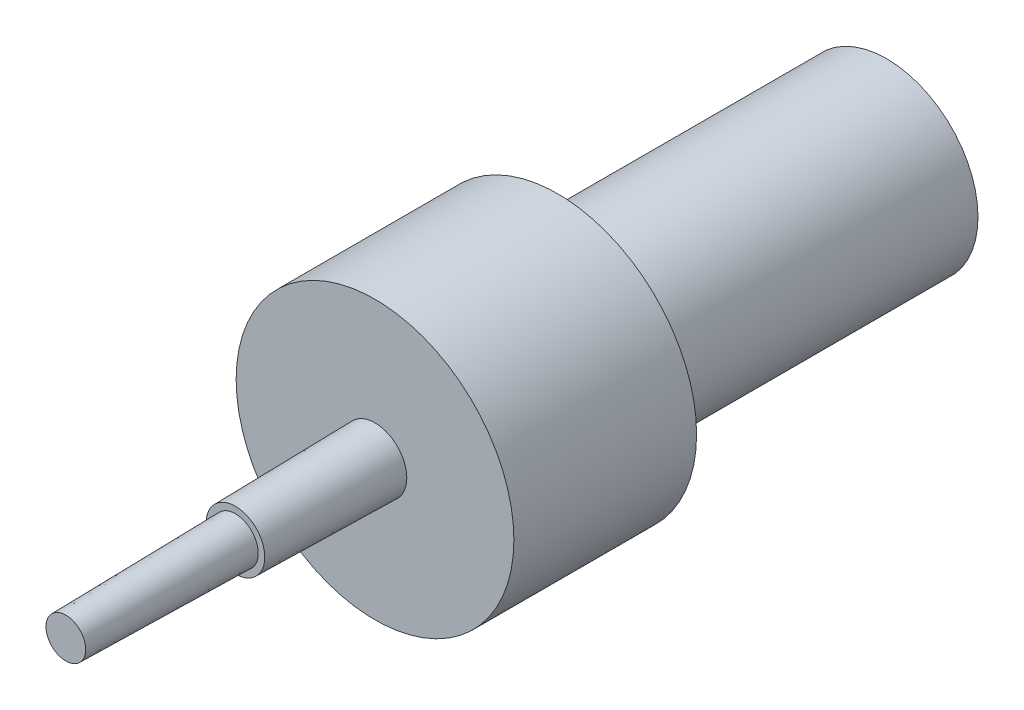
ISO-10303-21;
HEADER;
FILE_DESCRIPTION(('STEP AP214'),'2;1');
FILE_NAME('part.step','',(''),(''),'','','');
FILE_SCHEMA(('AUTOMOTIVE_DESIGN { 1 0 10303 214 1 1 1 1 }'));
ENDSEC;
DATA;
#1=APPLICATION_CONTEXT('core data for automotive mechanical design processes');
#2=APPLICATION_PROTOCOL_DEFINITION('international standard','automotive_design',2000,#1);
#3=PRODUCT_CONTEXT('',#1,'mechanical');
#4=PRODUCT('Part','Part','',(#3));
#5=PRODUCT_RELATED_PRODUCT_CATEGORY('part','',(#4));
#6=PRODUCT_DEFINITION_FORMATION('','',#4);
#7=PRODUCT_DEFINITION_CONTEXT('part definition',#1,'design');
#8=PRODUCT_DEFINITION('design','',#6,#7);
#9=PRODUCT_DEFINITION_SHAPE('','',#8);
#10=(LENGTH_UNIT() NAMED_UNIT(*) SI_UNIT(.MILLI.,.METRE.));
#11=(NAMED_UNIT(*) PLANE_ANGLE_UNIT() SI_UNIT($,.RADIAN.));
#12=(NAMED_UNIT(*) SI_UNIT($,.STERADIAN.) SOLID_ANGLE_UNIT());
#13=UNCERTAINTY_MEASURE_WITH_UNIT(LENGTH_MEASURE(1.E-05),#10,'distance_accuracy_value','');
#14=(GEOMETRIC_REPRESENTATION_CONTEXT(3) GLOBAL_UNCERTAINTY_ASSIGNED_CONTEXT((#13)) GLOBAL_UNIT_ASSIGNED_CONTEXT((#10,
#11,#12)) REPRESENTATION_CONTEXT('',''));
#15=CARTESIAN_POINT('',(0.,0.,0.));
#16=DIRECTION('',(0.,0.,1.));
#17=DIRECTION('',(1.,0.,0.));
#18=AXIS2_PLACEMENT_3D('',#15,#16,#17);
#19=CARTESIAN_POINT('',(0.,0.,0.));
#20=DIRECTION('',(0.,0.,1.));
#21=DIRECTION('',(1.,0.,0.));
#22=AXIS2_PLACEMENT_3D('',#19,#20,#21);
#23=PLANE('',#22);
#24=CARTESIAN_POINT('',(0.,0.,0.));
#25=DIRECTION('',(0.,0.,1.));
#26=DIRECTION('',(1.,0.,0.));
#27=AXIS2_PLACEMENT_3D('',#24,#25,#26);
#28=CIRCLE('',#27,3.8);
#29=CARTESIAN_POINT('',(3.8,0.,0.));
#30=VERTEX_POINT('',#29);
#31=EDGE_CURVE('E42',#30,#30,#28,.T.);
#32=ORIENTED_EDGE('',*,*,#31,.F.);
#33=EDGE_LOOP('',(#32));
#34=FACE_BOUND('',#33,.T.);
#35=CARTESIAN_POINT('',(0.,0.,0.));
#36=DIRECTION('',(0.,0.,1.));
#37=DIRECTION('',(1.,0.,0.));
#38=AXIS2_PLACEMENT_3D('',#35,#36,#37);
#39=CIRCLE('',#38,2.5);
#40=CARTESIAN_POINT('',(2.5,0.,0.));
#41=VERTEX_POINT('',#40);
#42=EDGE_CURVE('E10',#41,#41,#39,.F.);
#43=ORIENTED_EDGE('',*,*,#42,.F.);
#44=EDGE_LOOP('',(#43));
#45=FACE_BOUND('',#44,.T.);
#46=ADVANCED_FACE('F31',(#34,#45),#23,.F.);
#47=CARTESIAN_POINT('',(0.,0.,8.82));
#48=DIRECTION('',(0.,0.,1.));
#49=DIRECTION('',(1.,0.,0.));
#50=AXIS2_PLACEMENT_3D('',#47,#48,#49);
#51=PLANE('',#50);
#52=CARTESIAN_POINT('',(0.,0.,8.82));
#53=DIRECTION('',(0.,0.,1.));
#54=DIRECTION('',(1.,0.,0.));
#55=AXIS2_PLACEMENT_3D('',#52,#53,#54);
#56=CIRCLE('',#55,0.803321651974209);
#57=CARTESIAN_POINT('',(0.803321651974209,0.,8.82));
#58=VERTEX_POINT('',#57);
#59=EDGE_CURVE('E46',#58,#58,#56,.T.);
#60=ORIENTED_EDGE('',*,*,#59,.T.);
#61=EDGE_LOOP('',(#60));
#62=FACE_BOUND('',#61,.T.);
#63=CARTESIAN_POINT('',(0.,0.,8.82));
#64=DIRECTION('',(0.,0.,1.));
#65=DIRECTION('',(1.,0.,0.));
#66=AXIS2_PLACEMENT_3D('',#63,#64,#65);
#67=CIRCLE('',#66,0.625);
#68=CARTESIAN_POINT('',(0.625,0.,8.82));
#69=VERTEX_POINT('',#68);
#70=EDGE_CURVE('E57',#69,#69,#67,.T.);
#71=ORIENTED_EDGE('',*,*,#70,.F.);
#72=EDGE_LOOP('',(#71));
#73=FACE_BOUND('',#72,.T.);
#74=ADVANCED_FACE('F79',(#62,#73),#51,.T.);
#75=CARTESIAN_POINT('',(0.,0.,5.));
#76=DIRECTION('',(0.,0.,1.));
#77=DIRECTION('',(1.,0.,0.));
#78=AXIS2_PLACEMENT_3D('',#75,#76,#77);
#79=PLANE('',#78);
#80=CARTESIAN_POINT('',(0.,0.,5.));
#81=DIRECTION('',(0.,0.,1.));
#82=DIRECTION('',(1.,0.,0.));
#83=AXIS2_PLACEMENT_3D('',#80,#81,#82);
#84=CIRCLE('',#83,3.8);
#85=CARTESIAN_POINT('',(3.8,0.,5.));
#86=VERTEX_POINT('',#85);
#87=EDGE_CURVE('E38',#86,#86,#84,.T.);
#88=ORIENTED_EDGE('',*,*,#87,.T.);
#89=EDGE_LOOP('',(#88));
#90=FACE_BOUND('',#89,.T.);
#91=CARTESIAN_POINT('',(0.,0.,5.));
#92=DIRECTION('',(0.,0.,1.));
#93=DIRECTION('',(1.,0.,0.));
#94=AXIS2_PLACEMENT_3D('',#91,#92,#93);
#95=CIRCLE('',#94,0.87);
#96=CARTESIAN_POINT('',(0.87,0.,5.));
#97=VERTEX_POINT('',#96);
#98=EDGE_CURVE('E51',#97,#97,#95,.T.);
#99=ORIENTED_EDGE('',*,*,#98,.F.);
#100=EDGE_LOOP('',(#99));
#101=FACE_BOUND('',#100,.T.);
#102=ADVANCED_FACE('F85',(#90,#101),#79,.T.);
#103=CARTESIAN_POINT('',(0.,0.,5.));
#104=DIRECTION('',(0.,0.,-1.));
#105=DIRECTION('',(-1.,0.,0.));
#106=AXIS2_PLACEMENT_3D('',#103,#104,#105);
#107=CYLINDRICAL_SURFACE('',#106,3.8);
#108=ORIENTED_EDGE('',*,*,#87,.F.);
#109=EDGE_LOOP('',(#108));
#110=FACE_BOUND('',#109,.T.);
#111=ORIENTED_EDGE('',*,*,#31,.T.);
#112=EDGE_LOOP('',(#111));
#113=FACE_BOUND('',#112,.T.);
#114=ADVANCED_FACE('F33',(#110,#113),#107,.T.);
#115=CARTESIAN_POINT('',(0.,0.,5.));
#116=DIRECTION('',(0.,0.,-1.));
#117=DIRECTION('',(1.,0.,0.));
#118=AXIS2_PLACEMENT_3D('',#115,#116,#117);
#119=CONICAL_SURFACE('',#118,0.87,0.0174532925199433);
#120=ORIENTED_EDGE('',*,*,#59,.F.);
#121=EDGE_LOOP('',(#120));
#122=FACE_BOUND('',#121,.T.);
#123=ORIENTED_EDGE('',*,*,#98,.T.);
#124=EDGE_LOOP('',(#123));
#125=FACE_BOUND('',#124,.T.);
#126=ADVANCED_FACE('F91',(#122,#125),#119,.T.);
#127=CARTESIAN_POINT('',(0.,0.,8.82));
#128=DIRECTION('',(0.,0.,-1.));
#129=DIRECTION('',(1.,0.,0.));
#130=AXIS2_PLACEMENT_3D('',#127,#128,#129);
#131=CONICAL_SURFACE('',#130,0.625,0.0174532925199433);
#132=CARTESIAN_POINT('',(0.,0.,13.46));
#133=DIRECTION('',(0.,0.,1.));
#134=DIRECTION('',(1.,0.,0.));
#135=AXIS2_PLACEMENT_3D('',#132,#133,#134);
#136=CIRCLE('',#135,0.54400849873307);
#137=CARTESIAN_POINT('',(0.54400849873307,0.,13.46));
#138=VERTEX_POINT('',#137);
#139=EDGE_CURVE('E54',#138,#138,#136,.T.);
#140=ORIENTED_EDGE('',*,*,#139,.F.);
#141=EDGE_LOOP('',(#140));
#142=FACE_BOUND('',#141,.T.);
#143=ORIENTED_EDGE('',*,*,#70,.T.);
#144=EDGE_LOOP('',(#143));
#145=FACE_BOUND('',#144,.T.);
#146=ADVANCED_FACE('F75',(#142,#145),#131,.T.);
#147=CARTESIAN_POINT('',(0.,0.,13.46));
#148=DIRECTION('',(0.,0.,1.));
#149=DIRECTION('',(1.,0.,0.));
#150=AXIS2_PLACEMENT_3D('',#147,#148,#149);
#151=PLANE('',#150);
#152=ORIENTED_EDGE('',*,*,#139,.T.);
#153=EDGE_LOOP('',(#152));
#154=FACE_BOUND('',#153,.T.);
#155=ADVANCED_FACE('F68',(#154),#151,.T.);
#156=CARTESIAN_POINT('',(0.,0.,-9.));
#157=DIRECTION('',(0.,0.,1.));
#158=DIRECTION('',(1.,0.,0.));
#159=AXIS2_PLACEMENT_3D('',#156,#157,#158);
#160=CYLINDRICAL_SURFACE('',#159,2.5);
#161=CARTESIAN_POINT('',(0.,0.,-9.));
#162=DIRECTION('',(0.,0.,-1.));
#163=DIRECTION('',(-1.,0.,0.));
#164=AXIS2_PLACEMENT_3D('',#161,#162,#163);
#165=CIRCLE('',#164,2.5);
#166=CARTESIAN_POINT('',(-2.5,0.,-9.));
#167=VERTEX_POINT('',#166);
#168=EDGE_CURVE('E60',#167,#167,#165,.T.);
#169=ORIENTED_EDGE('',*,*,#168,.F.);
#170=EDGE_LOOP('',(#169));
#171=FACE_BOUND('',#170,.T.);
#172=ORIENTED_EDGE('',*,*,#42,.T.);
#173=EDGE_LOOP('',(#172));
#174=FACE_BOUND('',#173,.T.);
#175=ADVANCED_FACE('F66',(#171,#174),#160,.T.);
#176=CARTESIAN_POINT('',(0.,0.,-9.));
#177=DIRECTION('',(0.,0.,-1.));
#178=DIRECTION('',(-1.,0.,0.));
#179=AXIS2_PLACEMENT_3D('',#176,#177,#178);
#180=PLANE('',#179);
#181=ORIENTED_EDGE('',*,*,#168,.T.);
#182=EDGE_LOOP('',(#181));
#183=FACE_BOUND('',#182,.T.);
#184=ADVANCED_FACE('F64',(#183),#180,.T.);
#185=CLOSED_SHELL('',(#46,#74,#102,#114,#126,#146,#155,#175,#184));
#186=MANIFOLD_SOLID_BREP('B2',#185);
#187=ADVANCED_BREP_SHAPE_REPRESENTATION('',(#18,#186),#14);
#188=SHAPE_DEFINITION_REPRESENTATION(#9,#187);
ENDSEC;
END-ISO-10303-21;
